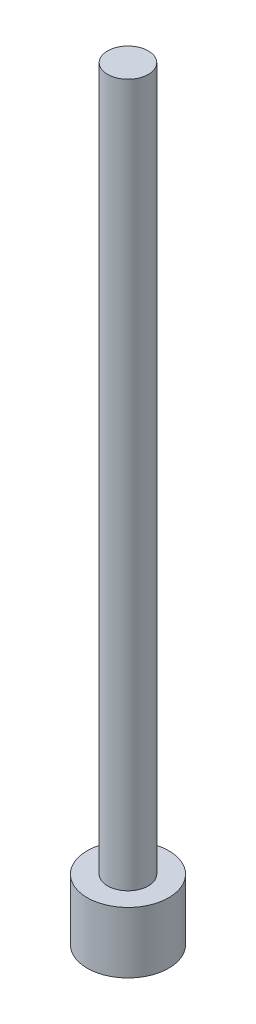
from build123d import *

# Parameters (mm, degrees)
ESQUISSE1_R      = 2
EXTRUSION1_DEPTH = 3
ESQUISSE2_R      = 1
EXTRUSION2_DEPTH = 34.5


with BuildPart() as part:
    # Esquisse1 → Extrusion1 (new body)
    with BuildSketch(Plane(origin=(0, 0, 0), x_dir=(1, 0, 0), z_dir=(0, 1, 0))):
        with Locations(Location((0, 0, 0), (0, 0, 270))):
            Circle(ESQUISSE1_R)
    extrude(amount=EXTRUSION1_DEPTH)

    # Esquisse2 → Extrusion2 (add)
    with BuildSketch(Plane(origin=(0, 3, 0), x_dir=(-1, 0, 0), z_dir=(0, 1, 0))):
        with Locations(Location((0, 0, 0), (0, 0, 90))):
            Circle(ESQUISSE2_R)
    extrude(amount=EXTRUSION2_DEPTH)


solid = part.part
